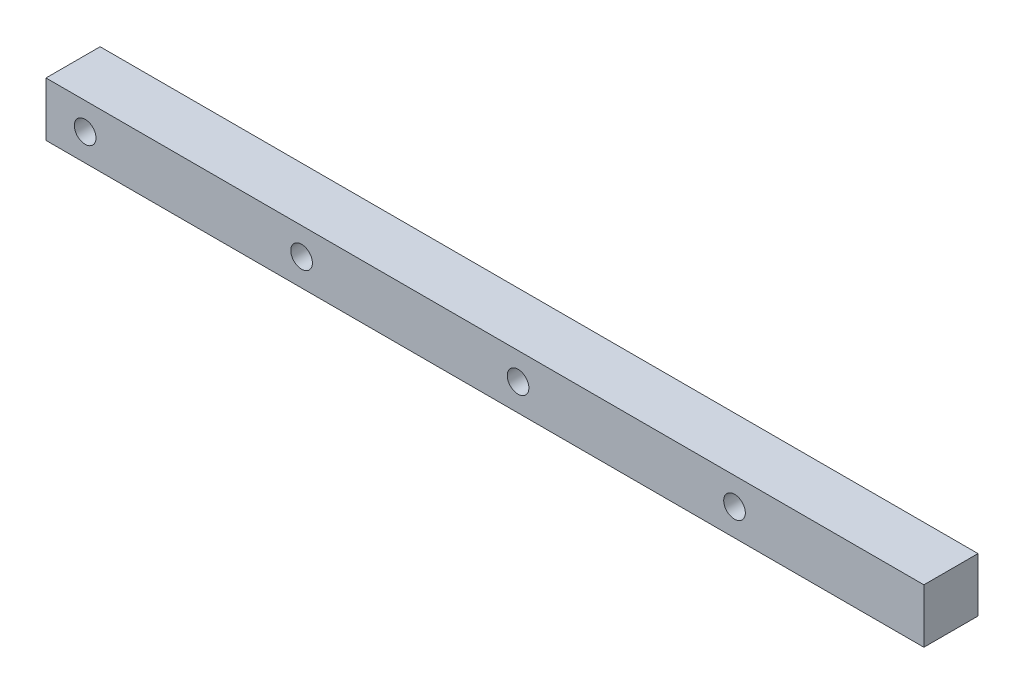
from build123d import *

# Parameters (mm, degrees)
ESQUISSE1_W                = 162.23
ESQUISSE1_H                = 10
BOSS_EXTRU_1_DEPTH         = 10
ESQUISSE2_R                = 2
ENL_V_MAT_EXTRU_1_DEPTH    = 10
R_P_TITION_LIN_AIRE1_COUNT = 4
R_P_TITION_LIN_AIRE1_PITCH = 40


with BuildPart() as part:
    # Esquisse1 → Boss.-Extru.1 (new body)
    with BuildSketch(Plane.XY):
        with Locations((81.115, 5)):
            Rectangle(ESQUISSE1_W, ESQUISSE1_H)
    extrude(amount=BOSS_EXTRU_1_DEPTH)

    # Esquisse2 → Enl_v. mat.-Extru.1 (cut)
    with BuildSketch(Plane.XY.offset(10)):
        with Locations((7.234179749, 5)):
            Circle(ESQUISSE2_R)
    enl_v_mat_extru_1 = extrude(amount=-ENL_V_MAT_EXTRU_1_DEPTH, mode=Mode.SUBTRACT)

    # R_p_tition lin_aire1: Enl_v. mat.-Extru.1 ×4
    with Locations(*[(i * R_P_TITION_LIN_AIRE1_PITCH, 0, 0) for i in range(1, R_P_TITION_LIN_AIRE1_COUNT)]):
        add(enl_v_mat_extru_1, mode=Mode.SUBTRACT)


solid = part.part
